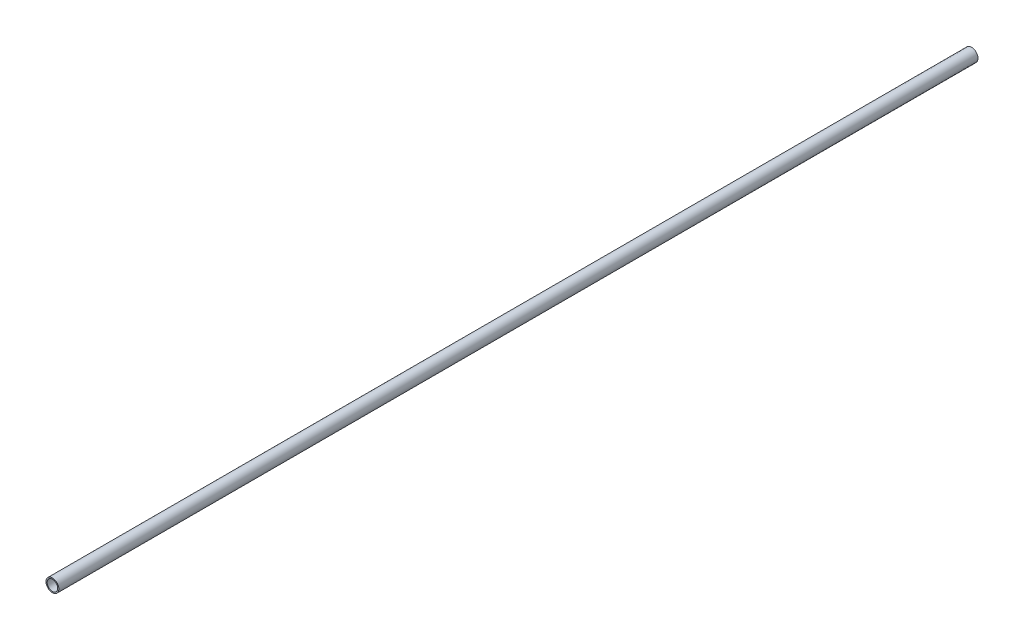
from build123d import *

# Parameters (mm, degrees)
ESQUISSE1_R      = 4.9
ESQUISSE1_R_2    = 4
EXTRUSION1_DEPTH = 700


with BuildPart() as part:
    # Esquisse1 → Extrusion1 (new body)
    with BuildSketch(Plane.XY):
        Circle(ESQUISSE1_R)
        Circle(ESQUISSE1_R_2, mode=Mode.SUBTRACT)
    extrude(amount=EXTRUSION1_DEPTH)


solid = part.part
